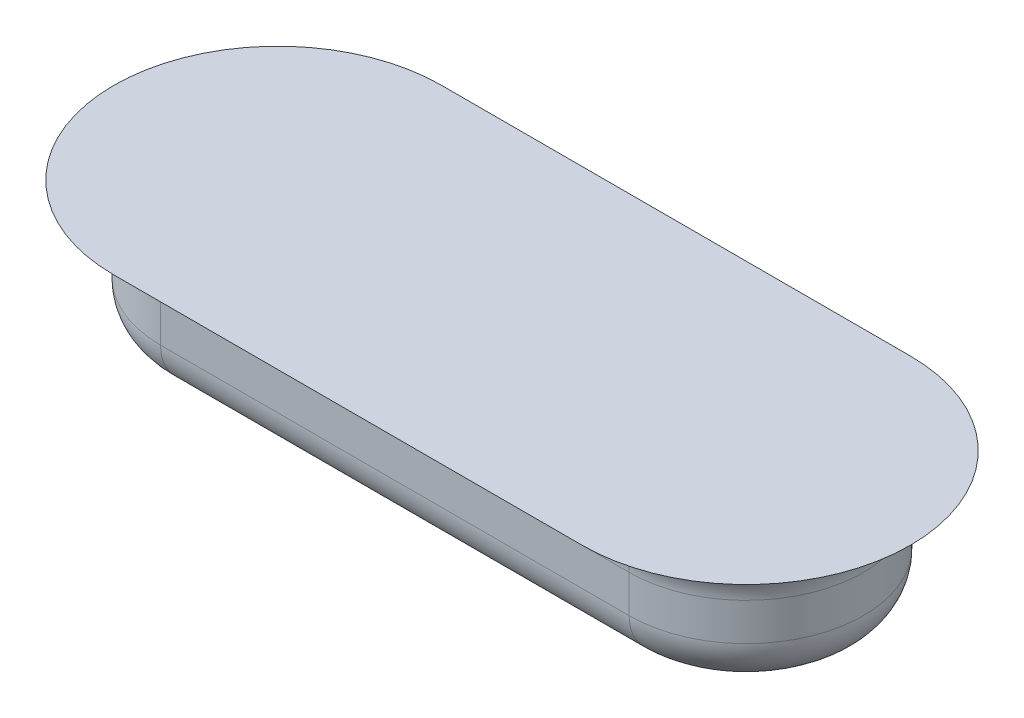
from build123d import *

# Parameters (mm, degrees)
SKETCH1_W          = 173.250746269
SKETCH1_H          = 121.313432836
EXTRUDE1_DEPTH     = 32.512
EXTRUDE2_DEPTH     = 14.224
FILLET1_R          = 5.08
SKETCH4_W          = 173.250746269
SKETCH4_H          = 121.313432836
CUT_EXTRUDE1_DEPTH = 117.755579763


with BuildPart() as part:
    # Sketch1 → Extrude1 (new body)
    with BuildSketch(Plane(origin=(0, 0, 0), x_dir=(1, 0, 0), z_dir=(0, 1, 0))):
        with Locations((6.444776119, -1.895522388)):
            Rectangle(SKETCH1_W, SKETCH1_H)
    extrude(amount=EXTRUDE1_DEPTH)

    # Sketch2 → Extrude2 (add)
    with BuildSketch(Plane.XZ):
        with BuildLine():
            Line((-25.4, -12.7), (25.4, -12.7))
            ThreePointArc((25.4, -12.7), (38.1, 0), (25.4, 12.7))
            Line((25.4, 12.7), (-25.4, 12.7))
            ThreePointArc((-25.4, 12.7), (-38.1, 0), (-25.4, -12.7))
        make_face()
    extrude(amount=EXTRUDE2_DEPTH)

    # Fillet1
    fillet1_edges = [part.edges().sort_by_distance(p)[0] for p in [
        (-38.1, 0, 0),
        (0, 0, -12.7),
        (38.1, 0, 0),
        (0, 0, 12.7),
        (-38.1, -14.224, 0),
        (0, -14.224, -12.7),
        (38.1, -14.224, 0),
        (0, -14.224, 12.7),
    ]]
    fillet(fillet1_edges, radius=FILLET1_R)

    # Sketch4 → Cut-Extrude1 (cut, through all)
    with BuildSketch(Plane.XZ):
        with Locations((6.444776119, 1.895522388)):
            Rectangle(SKETCH4_W, SKETCH4_H)
    extrude(amount=-CUT_EXTRUDE1_DEPTH, mode=Mode.SUBTRACT)


solid = part.part
